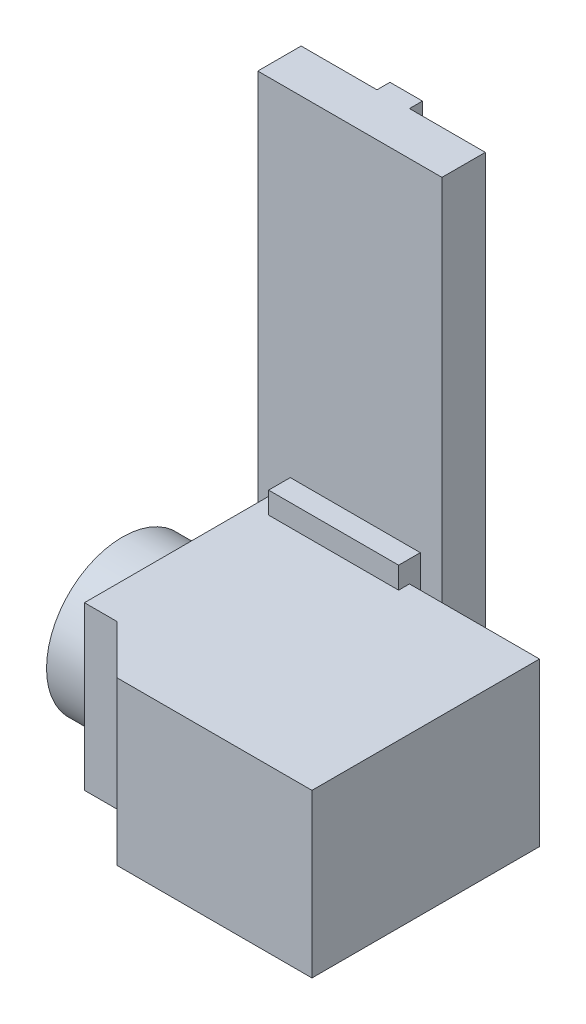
from build123d import *

# Parameters (mm, degrees)
ESQUISSE1_W           = 120
ESQUISSE1_H           = 190
EXTRUSION1_DEPTH      = 20
EXTRUSION2_DEPTH      = 75
EXTRUSION2_DEPTH_BACK = 75
ESQUISSE3_R           = 70
EXTRUSION3_DEPTH      = 40
ESQUISSE5_W           = 170
ESQUISSE5_H           = 500
EXTRUSION7_DEPTH      = 40
ESQUISSE6_W           = 30
ESQUISSE6_H           = 20
EXTRUSION8_DEPTH      = 500


with BuildPart() as part:
    # Esquisse1 → Extrusion1 (new body)
    with BuildSketch(Plane.XY):
        with Locations((60, 0)):
            Rectangle(ESQUISSE1_W, ESQUISSE1_H)
    extrude(amount=EXTRUSION1_DEPTH)

    # Esquisse2 → Extrusion2 (add, two sides: drawn at the far end of the back side and taken through both)
    with BuildSketch(Plane(origin=(0, 0, 0), x_dir=(1, 0, 0), z_dir=(0, 1, 0)).offset(-EXTRUSION2_DEPTH_BACK)):
        Polygon((120, -10), (240, -10), (240, -220), (60, -220), (15, -175), (-15, -175), (-15, 0), (0, 0), (120, 0), align=None)
    extrude(amount=EXTRUSION2_DEPTH + EXTRUSION2_DEPTH_BACK)

    # Esquisse3 → Extrusion3 (add)
    with BuildSketch(Plane.ZY.offset(15)):
        with Locations(Location((100, 0, 0), (0, 0, 180))):
            Circle(ESQUISSE3_R)
    extrude(amount=EXTRUSION3_DEPTH)

    # Esquisse5 → Extrusion7 (add)
    with BuildSketch(Plane(origin=(0, 0, 0), x_dir=(-1, 0, 0), z_dir=(0, 0, -1))):
        with Locations((-55, 155)):
            Rectangle(ESQUISSE5_W, ESQUISSE5_H)
    extrude(amount=EXTRUSION7_DEPTH)

    # Esquisse6 → Extrusion8 (add)
    with BuildSketch(Plane.XZ.offset(95)):
        with Locations((55, -42)):
            Rectangle(ESQUISSE6_W, ESQUISSE6_H)
    extrude(amount=-EXTRUSION8_DEPTH)


solid = part.part
